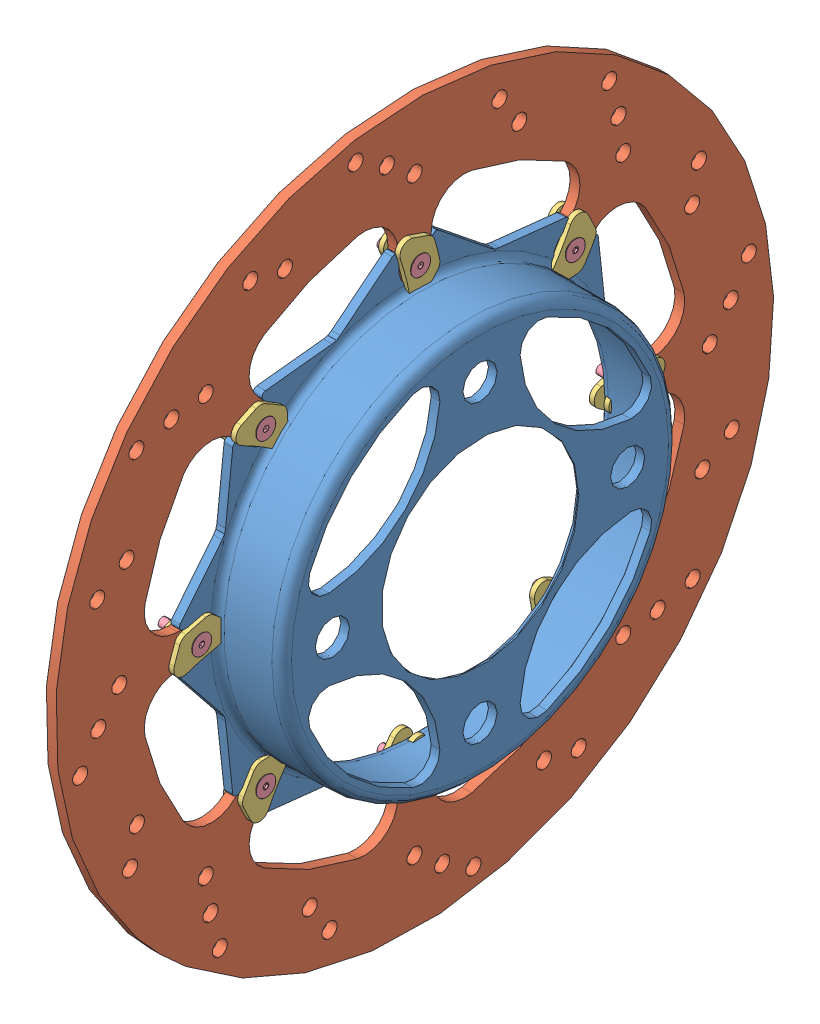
SolidWorks assembly Brake Rotor Assembly.SLDASM, configuration Default (file format 5000). Lengths in mm.
Overall size (31.81 327.78 327.78).
26 component instances, 4 part files, 10 mates.
Components (placement in the parent):
- Rotor Hat-1: Rotor Hat.SLDPRT [Default] at (-34.2242 30.4071 -2.5985) size (23.6 152.4 152.4)
- Rotor - Cast Iron-1: Rotor - Cast Iron.SLDPRT [Default] at (-34.926 30.4071 -2.5985) x (0 -0.707107 0.707107) z (1 0 0) size (231.78 231.78 3.17)
- Rotor Washer-1: Rotor Washer.SLDPRT [Default] at (-34.926 -45.1409 39.6169) x (0 -0.351842 0.936059) z (-1 0 0) size (18.57 10.78 1.59)
- Rotor Washer-27: Rotor Washer.SLDPRT [Chamfer] at (-31.751 -47.6779 47.6027) x (0 0.252895 -0.967494) z (1 0 0) size (18.57 10.78 1.59)
- Rotor Pin-6: Rotor Pin.SLDPRT [.5] at (-31.201 30.4071 68.0135) x (0 -0.458801 0.888539) z (1 0 0) size (6.36 6.36 12.79)
- Rotor Washer-13: Rotor Washer.SLDPRT [Default] at (-34.926 6.8374 80.6728) x (0 0.413104 0.910684) z (-1 0 0) size (18.57 10.78 1.59)
- Rotor Washer-14: Rotor Washer.SLDPRT [Default] at (-34.926 72.6224 72.9495) x (0 0.936059 0.351842) z (-1 0 0) size (18.57 10.78 1.59)
- Rotor Washer-15: Rotor Washer.SLDPRT [Default] at (-34.926 113.6783 20.9712) x (0 0.910684 -0.413104) z (-1 0 0) size (18.57 10.78 1.59)
- Rotor Washer-16: Rotor Washer.SLDPRT [Default] at (-34.926 105.955 -44.8139) x (0 0.351842 -0.936059) z (-1 0 0) size (18.57 10.78 1.59)
- Rotor Washer-17: Rotor Washer.SLDPRT [Default] at (-34.926 53.9768 -85.8697) x (0 -0.413104 -0.910684) z (-1 0 0) size (18.57 10.78 1.59)
- Rotor Pin-7: Rotor Pin.SLDPRT [.5] at (-31.201 80.3373 47.3317) x (0 0.30387 0.952713) z (1 0 0) size (6.36 6.36 12.79)
- Rotor Pin-8: Rotor Pin.SLDPRT [.5] at (-31.201 101.0191 -2.5985) x (0 0.888539 0.458801) z (1 0 0) size (6.36 6.36 12.79)
- Rotor Pin-9: Rotor Pin.SLDPRT [.5] at (-31.201 80.3373 -52.5287) x (0 0.952713 -0.30387) z (1 0 0) size (6.36 6.36 12.79)
- Rotor Pin-10: Rotor Pin.SLDPRT [.5] at (-31.201 30.4071 -73.2105) x (0 0.458801 -0.888539) z (1 0 0) size (6.36 6.36 12.79)
- Rotor Pin-11: Rotor Pin.SLDPRT [.5] at (-31.201 -19.5231 -52.5287) x (0 -0.30387 -0.952713) z (1 0 0) size (6.36 6.36 12.79)
- Rotor Pin-12: Rotor Pin.SLDPRT [.5] at (-31.201 -40.2049 -2.5985) x (0 -0.888539 -0.458801) z (1 0 0) size (6.36 6.36 12.79)
- Rotor Pin-13: Rotor Pin.SLDPRT [.5] at (-31.201 -19.5231 47.3317) x (0 -0.952713 0.30387) z (1 0 0) size (6.36 6.36 12.79)
- Rotor Washer-25: Rotor Washer.SLDPRT [Default] at (-34.926 -11.8083 -78.1464) x (0 -0.936059 -0.351842) z (-1 0 0) size (18.57 10.78 1.59)
- Rotor Washer-26: Rotor Washer.SLDPRT [Default] at (-34.926 -52.8642 -26.1682) x (0 -0.910684 0.413104) z (-1 0 0) size (18.57 10.78 1.59)
- Rotor Washer-28: Rotor Washer.SLDPRT [Chamfer] at (-31.751 10.6903 88.1135) x (0 -0.505298 -0.862945) z (1 0 0) size (18.57 10.78 1.59)
- Rotor Washer-29: Rotor Washer.SLDPRT [Chamfer] at (-31.751 80.6083 75.4865) x (0 -0.967494 -0.252895) z (1 0 0) size (18.57 10.78 1.59)
- Rotor Washer-30: Rotor Washer.SLDPRT [Chamfer] at (-31.751 121.1191 17.1183) x (0 -0.862945 0.505298) z (1 0 0) size (18.57 10.78 1.59)
- Rotor Washer-31: Rotor Washer.SLDPRT [Chamfer] at (-31.751 108.492 -52.7997) x (0 -0.252895 0.967494) z (1 0 0) size (18.57 10.78 1.59)
- Rotor Washer-32: Rotor Washer.SLDPRT [Chamfer] at (-31.751 50.1239 -93.3105) x (0 0.505298 0.862945) z (1 0 0) size (18.57 10.78 1.59)
- Rotor Washer-33: Rotor Washer.SLDPRT [Chamfer] at (-31.751 -19.7942 -80.6835) x (0 0.967494 0.252895) z (1 0 0) size (18.57 10.78 1.59)
- Rotor Washer-34: Rotor Washer.SLDPRT [Chamfer] at (-31.751 -60.305 -22.3153) x (0 0.862945 -0.505298) z (1 0 0) size (18.57 10.78 1.59)
Mates (geometry in assembly coordinates):
- Coincident1: coincident anti-aligned: plane of Rotor - Cast Iron-1 through (-34.927 106.8152 2.799) normal (0 0 1); plane of Rotor Hat-1 through (-10.6199 -44.5229 2.799) normal (0 0 -1)
- Distance1: distance = 0.1905 mm aligned: plane of Rotor Hat-1 through (-34.2242 95.5581 -2.5985) normal (-1 0 0); plane of Rotor - Cast Iron-1 through (-34.4147 210.7857 177.7802) normal (-1 0 0)
- Distance2: distance = 0.1905 mm aligned: plane of Rotor Hat-1 through (-34.2242 95.5581 -2.5985) normal (-1 0 0); plane of Rotor - Cast Iron-1 through (-31.2397 210.7857 177.7802) normal (1 0 0)
- Coincident3: coincident anti-aligned: plane of Rotor - Cast Iron-1 through (-34.926 210.7857 177.7802) normal (-1 0 0); plane of Rotor Washer-1 through (-34.926 31.8488 71.9473) normal (1 0 0)
- Concentric4: concentric aligned: cylinder of Rotor Washer-1 through (-36.5135 30.4071 68.0135) axis (1 0 0) radius 1.5875; cylinder of Rotor - Cast Iron-1 through (-34.927 30.4071 68.0135) axis (1 0 0) radius 1.5875
- Coincident5: coincident anti-aligned: plane of Rotor - Cast Iron-1 through (-31.751 210.7857 177.7802) normal (1 0 0); plane of Rotor Washer-27 through (-31.751 33.8548 65.633) normal (-1 0 0)
- Concentric9: concentric anti-aligned: cylinder of Rotor Pin-6 through (-31.201 30.4071 68.0135) axis (-1 0 0) radius 1.4224; cylinder of Rotor - Cast Iron-1 through (-34.927 30.4071 68.0135) axis (1 0 0) radius 1.5875
- Coincident6: coincident aligned: cone of Rotor Washer-27 through (-31.6245 30.4071 68.0135) axis (-1 0 0); cone of Rotor Pin-6 through (-29.7252 30.4071 68.0135) axis (-1 0 0)
- Concentric12: concentric anti-aligned: cylinder of Rotor - Cast Iron-1 through (-31.751 30.4071 -2.5985) axis (-1 0 0) radius 115.8875; circle of Rotor Hat-1
- Concentric13: concentric anti-aligned: cylinder of Rotor - Cast Iron-1 through (-31.751 30.4071 -2.5985) axis (-1 0 0) radius 115.8875; cylinder of Rotor Hat-1 through (-8.3543 30.4071 -2.5985) axis (1 0 0) radius 64.008
